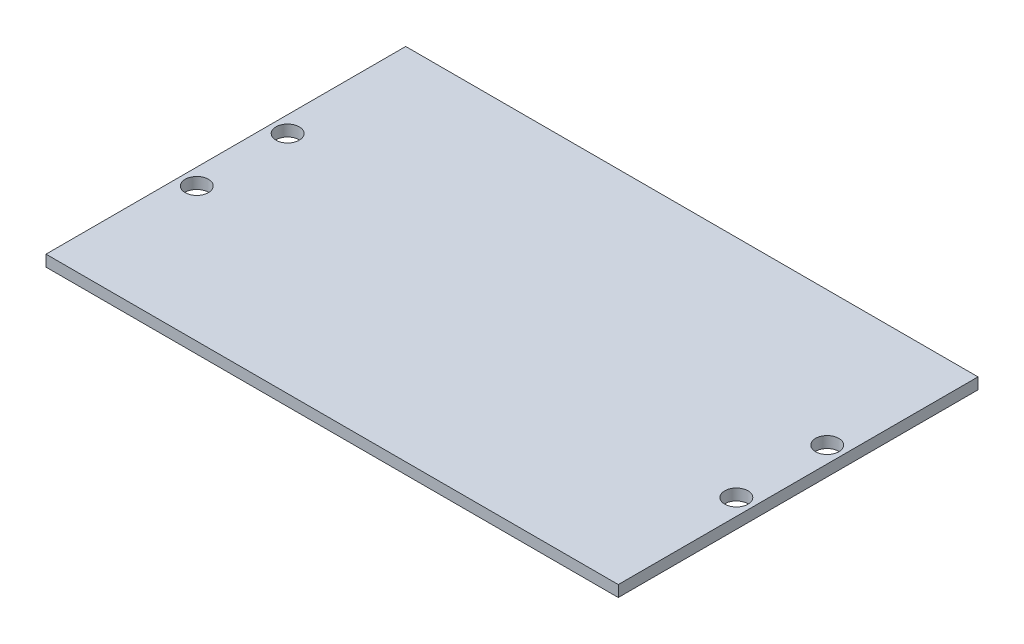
ISO-10303-21;
HEADER;
FILE_DESCRIPTION(('STEP AP214'),'2;1');
FILE_NAME('part.step','',(''),(''),'','','');
FILE_SCHEMA(('AUTOMOTIVE_DESIGN { 1 0 10303 214 1 1 1 1 }'));
ENDSEC;
DATA;
#1=APPLICATION_CONTEXT('core data for automotive mechanical design processes');
#2=APPLICATION_PROTOCOL_DEFINITION('international standard','automotive_design',2000,#1);
#3=PRODUCT_CONTEXT('',#1,'mechanical');
#4=PRODUCT('Part','Part','',(#3));
#5=PRODUCT_RELATED_PRODUCT_CATEGORY('part','',(#4));
#6=PRODUCT_DEFINITION_FORMATION('','',#4);
#7=PRODUCT_DEFINITION_CONTEXT('part definition',#1,'design');
#8=PRODUCT_DEFINITION('design','',#6,#7);
#9=PRODUCT_DEFINITION_SHAPE('','',#8);
#10=(LENGTH_UNIT() NAMED_UNIT(*) SI_UNIT(.MILLI.,.METRE.));
#11=(NAMED_UNIT(*) PLANE_ANGLE_UNIT() SI_UNIT($,.RADIAN.));
#12=(NAMED_UNIT(*) SI_UNIT($,.STERADIAN.) SOLID_ANGLE_UNIT());
#13=UNCERTAINTY_MEASURE_WITH_UNIT(LENGTH_MEASURE(1.E-05),#10,'distance_accuracy_value','');
#14=(GEOMETRIC_REPRESENTATION_CONTEXT(3) GLOBAL_UNCERTAINTY_ASSIGNED_CONTEXT((#13)) GLOBAL_UNIT_ASSIGNED_CONTEXT((#10,
#11,#12)) REPRESENTATION_CONTEXT('',''));
#15=CARTESIAN_POINT('',(0.,0.,0.));
#16=DIRECTION('',(0.,0.,1.));
#17=DIRECTION('',(1.,0.,0.));
#18=AXIS2_PLACEMENT_3D('',#15,#16,#17);
#19=CARTESIAN_POINT('',(40.005,1.5748,25.146));
#20=DIRECTION('',(-1.,0.,0.));
#21=DIRECTION('',(0.,0.,1.));
#22=AXIS2_PLACEMENT_3D('',#19,#20,#21);
#23=PLANE('',#22);
#24=DIRECTION('',(0.,0.,-1.));
#25=VECTOR('',#24,1.);
#26=CARTESIAN_POINT('',(40.005,0.,25.146));
#27=LINE('',#26,#25);
#28=CARTESIAN_POINT('',(40.005,0.,25.146));
#29=VERTEX_POINT('',#28);
#30=CARTESIAN_POINT('',(40.005,0.,-25.146));
#31=VERTEX_POINT('',#30);
#32=EDGE_CURVE('E95',#29,#31,#27,.T.);
#33=ORIENTED_EDGE('',*,*,#32,.T.);
#34=DIRECTION('',(0.,-1.,0.));
#35=VECTOR('',#34,1.);
#36=CARTESIAN_POINT('',(40.005,1.5748,-25.146));
#37=LINE('',#36,#35);
#38=CARTESIAN_POINT('',(40.005,1.5748,-25.146));
#39=VERTEX_POINT('',#38);
#40=EDGE_CURVE('E11',#39,#31,#37,.T.);
#41=ORIENTED_EDGE('',*,*,#40,.F.);
#42=DIRECTION('',(0.,0.,-1.));
#43=VECTOR('',#42,1.);
#44=CARTESIAN_POINT('',(40.005,1.5748,25.146));
#45=LINE('',#44,#43);
#46=CARTESIAN_POINT('',(40.005,1.5748,25.146));
#47=VERTEX_POINT('',#46);
#48=EDGE_CURVE('E83',#47,#39,#45,.T.);
#49=ORIENTED_EDGE('',*,*,#48,.F.);
#50=DIRECTION('',(0.,-1.,0.));
#51=VECTOR('',#50,1.);
#52=CARTESIAN_POINT('',(40.005,1.5748,25.146));
#53=LINE('',#52,#51);
#54=EDGE_CURVE('E91',#47,#29,#53,.T.);
#55=ORIENTED_EDGE('',*,*,#54,.T.);
#56=EDGE_LOOP('',(#33,#41,#49,#55));
#57=FACE_BOUND('',#56,.T.);
#58=ADVANCED_FACE('F32',(#57),#23,.F.);
#59=CARTESIAN_POINT('',(-40.0050000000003,1.5748,-25.146));
#60=DIRECTION('',(0.,0.,1.));
#61=DIRECTION('',(1.,0.,0.));
#62=AXIS2_PLACEMENT_3D('',#59,#60,#61);
#63=PLANE('',#62);
#64=DIRECTION('',(-1.,0.,0.));
#65=VECTOR('',#64,1.);
#66=CARTESIAN_POINT('',(-40.0050000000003,0.,-25.146));
#67=LINE('',#66,#65);
#68=CARTESIAN_POINT('',(-40.0050000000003,0.,-25.146));
#69=VERTEX_POINT('',#68);
#70=EDGE_CURVE('E87',#31,#69,#67,.T.);
#71=ORIENTED_EDGE('',*,*,#70,.T.);
#72=DIRECTION('',(0.,-1.,0.));
#73=VECTOR('',#72,1.);
#74=CARTESIAN_POINT('',(-40.0050000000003,1.5748,-25.146));
#75=LINE('',#74,#73);
#76=CARTESIAN_POINT('',(-40.0050000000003,1.5748,-25.146));
#77=VERTEX_POINT('',#76);
#78=EDGE_CURVE('E40',#77,#69,#75,.T.);
#79=ORIENTED_EDGE('',*,*,#78,.F.);
#80=DIRECTION('',(-1.,0.,0.));
#81=VECTOR('',#80,1.);
#82=CARTESIAN_POINT('',(-40.0050000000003,1.5748,-25.146));
#83=LINE('',#82,#81);
#84=EDGE_CURVE('E78',#39,#77,#83,.T.);
#85=ORIENTED_EDGE('',*,*,#84,.F.);
#86=ORIENTED_EDGE('',*,*,#40,.T.);
#87=EDGE_LOOP('',(#71,#79,#85,#86));
#88=FACE_BOUND('',#87,.T.);
#89=ADVANCED_FACE('F86',(#88),#63,.F.);
#90=CARTESIAN_POINT('',(-40.005,1.5748,25.146));
#91=DIRECTION('',(1.,0.,0.));
#92=DIRECTION('',(0.,0.,-1.));
#93=AXIS2_PLACEMENT_3D('',#90,#91,#92);
#94=PLANE('',#93);
#95=DIRECTION('',(0.,0.,1.));
#96=VECTOR('',#95,1.);
#97=CARTESIAN_POINT('',(-40.005,0.,25.146));
#98=LINE('',#97,#96);
#99=CARTESIAN_POINT('',(-40.005,0.,25.146));
#100=VERTEX_POINT('',#99);
#101=EDGE_CURVE('E65',#69,#100,#98,.T.);
#102=ORIENTED_EDGE('',*,*,#101,.T.);
#103=DIRECTION('',(0.,-1.,0.));
#104=VECTOR('',#103,1.);
#105=CARTESIAN_POINT('',(-40.005,1.5748,25.146));
#106=LINE('',#105,#104);
#107=CARTESIAN_POINT('',(-40.005,1.5748,25.146));
#108=VERTEX_POINT('',#107);
#109=EDGE_CURVE('E88',#108,#100,#106,.T.);
#110=ORIENTED_EDGE('',*,*,#109,.F.);
#111=DIRECTION('',(0.,0.,1.));
#112=VECTOR('',#111,1.);
#113=CARTESIAN_POINT('',(-40.005,1.5748,25.146));
#114=LINE('',#113,#112);
#115=EDGE_CURVE('E81',#77,#108,#114,.T.);
#116=ORIENTED_EDGE('',*,*,#115,.F.);
#117=ORIENTED_EDGE('',*,*,#78,.T.);
#118=EDGE_LOOP('',(#102,#110,#116,#117));
#119=FACE_BOUND('',#118,.T.);
#120=ADVANCED_FACE('F89',(#119),#94,.F.);
#121=CARTESIAN_POINT('',(-40.005,1.5748,25.146));
#122=DIRECTION('',(0.,0.,-1.));
#123=DIRECTION('',(-1.,0.,0.));
#124=AXIS2_PLACEMENT_3D('',#121,#122,#123);
#125=PLANE('',#124);
#126=DIRECTION('',(1.,0.,0.));
#127=VECTOR('',#126,1.);
#128=CARTESIAN_POINT('',(-40.005,0.,25.146));
#129=LINE('',#128,#127);
#130=EDGE_CURVE('E71',#100,#29,#129,.T.);
#131=ORIENTED_EDGE('',*,*,#130,.T.);
#132=ORIENTED_EDGE('',*,*,#54,.F.);
#133=DIRECTION('',(1.,0.,0.));
#134=VECTOR('',#133,1.);
#135=CARTESIAN_POINT('',(-40.005,1.5748,25.146));
#136=LINE('',#135,#134);
#137=EDGE_CURVE('E48',#108,#47,#136,.T.);
#138=ORIENTED_EDGE('',*,*,#137,.F.);
#139=ORIENTED_EDGE('',*,*,#109,.T.);
#140=EDGE_LOOP('',(#131,#132,#138,#139));
#141=FACE_BOUND('',#140,.T.);
#142=ADVANCED_FACE('F103',(#141),#125,.F.);
#143=CARTESIAN_POINT('',(0.,1.5748,0.));
#144=DIRECTION('',(0.,-1.,0.));
#145=DIRECTION('',(0.,0.,-1.));
#146=AXIS2_PLACEMENT_3D('',#143,#144,#145);
#147=PLANE('',#146);
#148=CARTESIAN_POINT('',(37.719,1.5748,6.34999999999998));
#149=DIRECTION('',(0.,1.,0.));
#150=DIRECTION('',(0.,0.,1.));
#151=AXIS2_PLACEMENT_3D('',#148,#149,#150);
#152=CIRCLE('',#151,1.6256);
#153=CARTESIAN_POINT('',(37.719,1.5748,7.97559999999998));
#154=VERTEX_POINT('',#153);
#155=EDGE_CURVE('E127',#154,#154,#152,.T.);
#156=ORIENTED_EDGE('',*,*,#155,.F.);
#157=EDGE_LOOP('',(#156));
#158=FACE_BOUND('',#157,.T.);
#159=CARTESIAN_POINT('',(37.719,1.5748,-6.35000000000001));
#160=DIRECTION('',(0.,1.,0.));
#161=DIRECTION('',(0.,0.,1.));
#162=AXIS2_PLACEMENT_3D('',#159,#160,#161);
#163=CIRCLE('',#162,1.6256);
#164=CARTESIAN_POINT('',(37.719,1.5748,-4.72440000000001));
#165=VERTEX_POINT('',#164);
#166=EDGE_CURVE('E121',#165,#165,#163,.T.);
#167=ORIENTED_EDGE('',*,*,#166,.F.);
#168=EDGE_LOOP('',(#167));
#169=FACE_BOUND('',#168,.T.);
#170=CARTESIAN_POINT('',(-37.7190000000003,1.5748,6.34999999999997));
#171=DIRECTION('',(0.,1.,0.));
#172=DIRECTION('',(0.,0.,1.));
#173=AXIS2_PLACEMENT_3D('',#170,#171,#172);
#174=CIRCLE('',#173,1.6256);
#175=CARTESIAN_POINT('',(-37.7190000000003,1.5748,7.97559999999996));
#176=VERTEX_POINT('',#175);
#177=EDGE_CURVE('E115',#176,#176,#174,.T.);
#178=ORIENTED_EDGE('',*,*,#177,.F.);
#179=EDGE_LOOP('',(#178));
#180=FACE_BOUND('',#179,.T.);
#181=CARTESIAN_POINT('',(-37.719,1.5748,-6.35000000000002));
#182=DIRECTION('',(0.,1.,0.));
#183=DIRECTION('',(0.,0.,1.));
#184=AXIS2_PLACEMENT_3D('',#181,#182,#183);
#185=CIRCLE('',#184,1.6256);
#186=CARTESIAN_POINT('',(-37.719,1.5748,-4.72440000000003));
#187=VERTEX_POINT('',#186);
#188=EDGE_CURVE('E109',#187,#187,#185,.T.);
#189=ORIENTED_EDGE('',*,*,#188,.F.);
#190=EDGE_LOOP('',(#189));
#191=FACE_BOUND('',#190,.T.);
#192=ORIENTED_EDGE('',*,*,#48,.T.);
#193=ORIENTED_EDGE('',*,*,#84,.T.);
#194=ORIENTED_EDGE('',*,*,#115,.T.);
#195=ORIENTED_EDGE('',*,*,#137,.T.);
#196=EDGE_LOOP('',(#192,#193,#194,#195));
#197=FACE_BOUND('',#196,.T.);
#198=ADVANCED_FACE('F79',(#158,#169,#180,#191,#197),#147,.F.);
#199=CARTESIAN_POINT('',(0.,0.,0.));
#200=DIRECTION('',(0.,-1.,0.));
#201=DIRECTION('',(0.,0.,-1.));
#202=AXIS2_PLACEMENT_3D('',#199,#200,#201);
#203=PLANE('',#202);
#204=CARTESIAN_POINT('',(37.719,0.,6.34999999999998));
#205=DIRECTION('',(0.,1.,0.));
#206=DIRECTION('',(0.,0.,1.));
#207=AXIS2_PLACEMENT_3D('',#204,#205,#206);
#208=CIRCLE('',#207,1.6256);
#209=CARTESIAN_POINT('',(37.719,0.,7.97559999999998));
#210=VERTEX_POINT('',#209);
#211=EDGE_CURVE('E124',#210,#210,#208,.T.);
#212=ORIENTED_EDGE('',*,*,#211,.T.);
#213=EDGE_LOOP('',(#212));
#214=FACE_BOUND('',#213,.T.);
#215=CARTESIAN_POINT('',(37.719,0.,-6.35000000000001));
#216=DIRECTION('',(0.,1.,0.));
#217=DIRECTION('',(0.,0.,1.));
#218=AXIS2_PLACEMENT_3D('',#215,#216,#217);
#219=CIRCLE('',#218,1.6256);
#220=CARTESIAN_POINT('',(37.719,0.,-4.72440000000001));
#221=VERTEX_POINT('',#220);
#222=EDGE_CURVE('E118',#221,#221,#219,.T.);
#223=ORIENTED_EDGE('',*,*,#222,.T.);
#224=EDGE_LOOP('',(#223));
#225=FACE_BOUND('',#224,.T.);
#226=CARTESIAN_POINT('',(-37.7190000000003,0.,6.34999999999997));
#227=DIRECTION('',(0.,1.,0.));
#228=DIRECTION('',(0.,0.,1.));
#229=AXIS2_PLACEMENT_3D('',#226,#227,#228);
#230=CIRCLE('',#229,1.6256);
#231=CARTESIAN_POINT('',(-37.7190000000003,0.,7.97559999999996));
#232=VERTEX_POINT('',#231);
#233=EDGE_CURVE('E112',#232,#232,#230,.T.);
#234=ORIENTED_EDGE('',*,*,#233,.T.);
#235=EDGE_LOOP('',(#234));
#236=FACE_BOUND('',#235,.T.);
#237=CARTESIAN_POINT('',(-37.719,0.,-6.35000000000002));
#238=DIRECTION('',(0.,1.,0.));
#239=DIRECTION('',(0.,0.,1.));
#240=AXIS2_PLACEMENT_3D('',#237,#238,#239);
#241=CIRCLE('',#240,1.6256);
#242=CARTESIAN_POINT('',(-37.719,0.,-4.72440000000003));
#243=VERTEX_POINT('',#242);
#244=EDGE_CURVE('E98',#243,#243,#241,.T.);
#245=ORIENTED_EDGE('',*,*,#244,.T.);
#246=EDGE_LOOP('',(#245));
#247=FACE_BOUND('',#246,.T.);
#248=ORIENTED_EDGE('',*,*,#32,.F.);
#249=ORIENTED_EDGE('',*,*,#130,.F.);
#250=ORIENTED_EDGE('',*,*,#101,.F.);
#251=ORIENTED_EDGE('',*,*,#70,.F.);
#252=EDGE_LOOP('',(#248,#249,#250,#251));
#253=FACE_BOUND('',#252,.T.);
#254=ADVANCED_FACE('F106',(#214,#225,#236,#247,#253),#203,.T.);
#255=CARTESIAN_POINT('',(-37.719,0.,-6.35000000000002));
#256=DIRECTION('',(0.,1.,0.));
#257=DIRECTION('',(0.,0.,1.));
#258=AXIS2_PLACEMENT_3D('',#255,#256,#257);
#259=CYLINDRICAL_SURFACE('',#258,1.6256);
#260=ORIENTED_EDGE('',*,*,#244,.F.);
#261=EDGE_LOOP('',(#260));
#262=FACE_BOUND('',#261,.T.);
#263=ORIENTED_EDGE('',*,*,#188,.T.);
#264=EDGE_LOOP('',(#263));
#265=FACE_BOUND('',#264,.T.);
#266=ADVANCED_FACE('F151',(#262,#265),#259,.F.);
#267=CARTESIAN_POINT('',(-37.7190000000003,0.,6.34999999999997));
#268=DIRECTION('',(0.,1.,0.));
#269=DIRECTION('',(0.,0.,1.));
#270=AXIS2_PLACEMENT_3D('',#267,#268,#269);
#271=CYLINDRICAL_SURFACE('',#270,1.6256);
#272=ORIENTED_EDGE('',*,*,#233,.F.);
#273=EDGE_LOOP('',(#272));
#274=FACE_BOUND('',#273,.T.);
#275=ORIENTED_EDGE('',*,*,#177,.T.);
#276=EDGE_LOOP('',(#275));
#277=FACE_BOUND('',#276,.T.);
#278=ADVANCED_FACE('F153',(#274,#277),#271,.F.);
#279=CARTESIAN_POINT('',(37.719,0.,-6.35000000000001));
#280=DIRECTION('',(0.,1.,0.));
#281=DIRECTION('',(0.,0.,1.));
#282=AXIS2_PLACEMENT_3D('',#279,#280,#281);
#283=CYLINDRICAL_SURFACE('',#282,1.6256);
#284=ORIENTED_EDGE('',*,*,#222,.F.);
#285=EDGE_LOOP('',(#284));
#286=FACE_BOUND('',#285,.T.);
#287=ORIENTED_EDGE('',*,*,#166,.T.);
#288=EDGE_LOOP('',(#287));
#289=FACE_BOUND('',#288,.T.);
#290=ADVANCED_FACE('F138',(#286,#289),#283,.F.);
#291=CARTESIAN_POINT('',(37.719,0.,6.34999999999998));
#292=DIRECTION('',(0.,1.,0.));
#293=DIRECTION('',(0.,0.,1.));
#294=AXIS2_PLACEMENT_3D('',#291,#292,#293);
#295=CYLINDRICAL_SURFACE('',#294,1.6256);
#296=ORIENTED_EDGE('',*,*,#211,.F.);
#297=EDGE_LOOP('',(#296));
#298=FACE_BOUND('',#297,.T.);
#299=ORIENTED_EDGE('',*,*,#155,.T.);
#300=EDGE_LOOP('',(#299));
#301=FACE_BOUND('',#300,.T.);
#302=ADVANCED_FACE('F135',(#298,#301),#295,.F.);
#303=CLOSED_SHELL('',(#58,#89,#120,#142,#198,#254,#266,#278,#290,#302));
#304=MANIFOLD_SOLID_BREP('B2',#303);
#305=ADVANCED_BREP_SHAPE_REPRESENTATION('',(#18,#304),#14);
#306=SHAPE_DEFINITION_REPRESENTATION(#9,#305);
ENDSEC;
END-ISO-10303-21;
